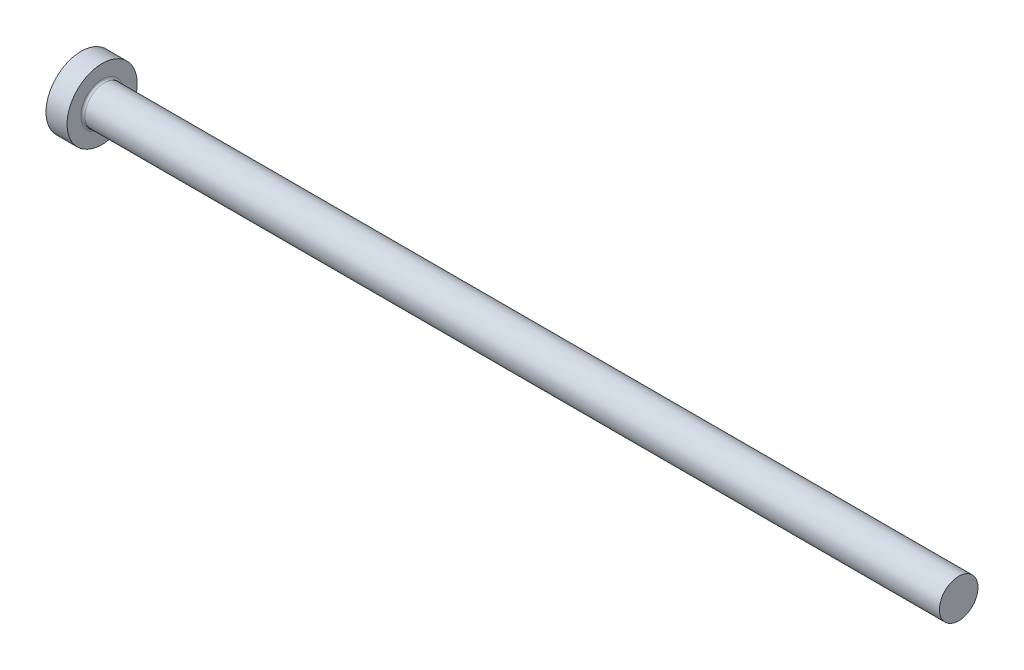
ISO-10303-21;
HEADER;
FILE_DESCRIPTION(('STEP AP214'),'2;1');
FILE_NAME('part.step','',(''),(''),'','','');
FILE_SCHEMA(('AUTOMOTIVE_DESIGN { 1 0 10303 214 1 1 1 1 }'));
ENDSEC;
DATA;
#1=APPLICATION_CONTEXT('core data for automotive mechanical design processes');
#2=APPLICATION_PROTOCOL_DEFINITION('international standard','automotive_design',2000,#1);
#3=PRODUCT_CONTEXT('',#1,'mechanical');
#4=PRODUCT('Part','Part','',(#3));
#5=PRODUCT_RELATED_PRODUCT_CATEGORY('part','',(#4));
#6=PRODUCT_DEFINITION_FORMATION('','',#4);
#7=PRODUCT_DEFINITION_CONTEXT('part definition',#1,'design');
#8=PRODUCT_DEFINITION('design','',#6,#7);
#9=PRODUCT_DEFINITION_SHAPE('','',#8);
#10=(LENGTH_UNIT() NAMED_UNIT(*) SI_UNIT(.MILLI.,.METRE.));
#11=(NAMED_UNIT(*) PLANE_ANGLE_UNIT() SI_UNIT($,.RADIAN.));
#12=(NAMED_UNIT(*) SI_UNIT($,.STERADIAN.) SOLID_ANGLE_UNIT());
#13=UNCERTAINTY_MEASURE_WITH_UNIT(LENGTH_MEASURE(1.E-05),#10,'distance_accuracy_value','');
#14=(GEOMETRIC_REPRESENTATION_CONTEXT(3) GLOBAL_UNCERTAINTY_ASSIGNED_CONTEXT((#13)) GLOBAL_UNIT_ASSIGNED_CONTEXT((#10,
#11,#12)) REPRESENTATION_CONTEXT('',''));
#15=CARTESIAN_POINT('',(0.,0.,0.));
#16=DIRECTION('',(0.,0.,1.));
#17=DIRECTION('',(1.,0.,0.));
#18=AXIS2_PLACEMENT_3D('',#15,#16,#17);
#19=CARTESIAN_POINT('',(0.,0.,0.));
#20=DIRECTION('',(-1.,0.,0.));
#21=DIRECTION('',(0.,-1.,0.));
#22=AXIS2_PLACEMENT_3D('',#19,#20,#21);
#23=PLANE('',#22);
#24=CARTESIAN_POINT('',(0.,0.,0.));
#25=DIRECTION('',(1.,0.,0.));
#26=DIRECTION('',(0.,1.,0.));
#27=AXIS2_PLACEMENT_3D('',#24,#25,#26);
#28=CIRCLE('',#27,5.);
#29=CARTESIAN_POINT('',(0.,5.,0.));
#30=VERTEX_POINT('',#29);
#31=EDGE_CURVE('E25',#30,#30,#28,.T.);
#32=ORIENTED_EDGE('',*,*,#31,.F.);
#33=EDGE_LOOP('',(#32));
#34=FACE_BOUND('',#33,.T.);
#35=ADVANCED_FACE('F14',(#34),#23,.T.);
#36=CARTESIAN_POINT('',(125.,-1.07156594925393E-13,0.));
#37=DIRECTION('',(1.,0.,0.));
#38=DIRECTION('',(0.,1.,0.));
#39=AXIS2_PLACEMENT_3D('',#36,#37,#38);
#40=CYLINDRICAL_SURFACE('',#39,5.);
#41=ORIENTED_EDGE('',*,*,#31,.T.);
#42=EDGE_LOOP('',(#41));
#43=FACE_BOUND('',#42,.T.);
#44=CARTESIAN_POINT('',(3.,0.,0.));
#45=DIRECTION('',(1.,0.,0.));
#46=DIRECTION('',(0.,1.,0.));
#47=AXIS2_PLACEMENT_3D('',#44,#45,#46);
#48=CIRCLE('',#47,5.);
#49=CARTESIAN_POINT('',(3.,5.,0.));
#50=VERTEX_POINT('',#49);
#51=EDGE_CURVE('E29',#50,#50,#48,.T.);
#52=ORIENTED_EDGE('',*,*,#51,.F.);
#53=EDGE_LOOP('',(#52));
#54=FACE_BOUND('',#53,.T.);
#55=ADVANCED_FACE('F51',(#43,#54),#40,.T.);
#56=CARTESIAN_POINT('',(3.,5.,0.));
#57=DIRECTION('',(1.,0.,0.));
#58=DIRECTION('',(0.,1.,0.));
#59=AXIS2_PLACEMENT_3D('',#56,#57,#58);
#60=PLANE('',#59);
#61=CARTESIAN_POINT('',(3.,0.,0.));
#62=DIRECTION('',(1.,0.,0.));
#63=DIRECTION('',(0.,1.,0.));
#64=AXIS2_PLACEMENT_3D('',#61,#62,#63);
#65=CIRCLE('',#64,3.04999999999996);
#66=CARTESIAN_POINT('',(3.,3.04999999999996,0.));
#67=VERTEX_POINT('',#66);
#68=EDGE_CURVE('E9',#67,#67,#65,.F.);
#69=ORIENTED_EDGE('',*,*,#68,.T.);
#70=EDGE_LOOP('',(#69));
#71=FACE_BOUND('',#70,.T.);
#72=ORIENTED_EDGE('',*,*,#51,.T.);
#73=EDGE_LOOP('',(#72));
#74=FACE_BOUND('',#73,.T.);
#75=ADVANCED_FACE('F42',(#71,#74),#60,.T.);
#76=CARTESIAN_POINT('',(125.,-1.07156594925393E-13,0.));
#77=DIRECTION('',(1.,0.,0.));
#78=DIRECTION('',(0.,1.,0.));
#79=AXIS2_PLACEMENT_3D('',#76,#77,#78);
#80=CYLINDRICAL_SURFACE('',#79,2.74999999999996);
#81=CARTESIAN_POINT('',(3.3,0.,0.));
#82=DIRECTION('',(1.,0.,0.));
#83=DIRECTION('',(0.,1.,0.));
#84=AXIS2_PLACEMENT_3D('',#81,#82,#83);
#85=CIRCLE('',#84,2.74999999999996);
#86=CARTESIAN_POINT('',(3.3,2.74999999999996,0.));
#87=VERTEX_POINT('',#86);
#88=EDGE_CURVE('E21',#87,#87,#85,.T.);
#89=ORIENTED_EDGE('',*,*,#88,.T.);
#90=EDGE_LOOP('',(#89));
#91=FACE_BOUND('',#90,.T.);
#92=CARTESIAN_POINT('',(125.,-1.07156594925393E-13,0.));
#93=DIRECTION('',(1.,0.,0.));
#94=DIRECTION('',(0.,1.,0.));
#95=AXIS2_PLACEMENT_3D('',#92,#93,#94);
#96=CIRCLE('',#95,2.75);
#97=CARTESIAN_POINT('',(125.,2.74999999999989,0.));
#98=VERTEX_POINT('',#97);
#99=EDGE_CURVE('E34',#98,#98,#96,.T.);
#100=ORIENTED_EDGE('',*,*,#99,.F.);
#101=EDGE_LOOP('',(#100));
#102=FACE_BOUND('',#101,.T.);
#103=ADVANCED_FACE('F40',(#91,#102),#80,.T.);
#104=CARTESIAN_POINT('',(125.,2.74999999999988,0.));
#105=DIRECTION('',(1.,0.,0.));
#106=DIRECTION('',(0.,1.,0.));
#107=AXIS2_PLACEMENT_3D('',#104,#105,#106);
#108=PLANE('',#107);
#109=ORIENTED_EDGE('',*,*,#99,.T.);
#110=EDGE_LOOP('',(#109));
#111=FACE_BOUND('',#110,.T.);
#112=ADVANCED_FACE('F38',(#111),#108,.T.);
#113=CARTESIAN_POINT('',(3.3,0.,0.));
#114=DIRECTION('',(1.,0.,0.));
#115=DIRECTION('',(0.,1.,0.));
#116=AXIS2_PLACEMENT_3D('',#113,#114,#115);
#117=TOROIDAL_SURFACE('',#116,3.04999999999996,0.3);
#118=ORIENTED_EDGE('',*,*,#68,.F.);
#119=EDGE_LOOP('',(#118));
#120=FACE_BOUND('',#119,.T.);
#121=ORIENTED_EDGE('',*,*,#88,.F.);
#122=EDGE_LOOP('',(#121));
#123=FACE_BOUND('',#122,.T.);
#124=ADVANCED_FACE('F16',(#120,#123),#117,.F.);
#125=CLOSED_SHELL('',(#35,#55,#75,#103,#112,#124));
#126=MANIFOLD_SOLID_BREP('B1',#125);
#127=ADVANCED_BREP_SHAPE_REPRESENTATION('',(#18,#126),#14);
#128=SHAPE_DEFINITION_REPRESENTATION(#9,#127);
ENDSEC;
END-ISO-10303-21;
